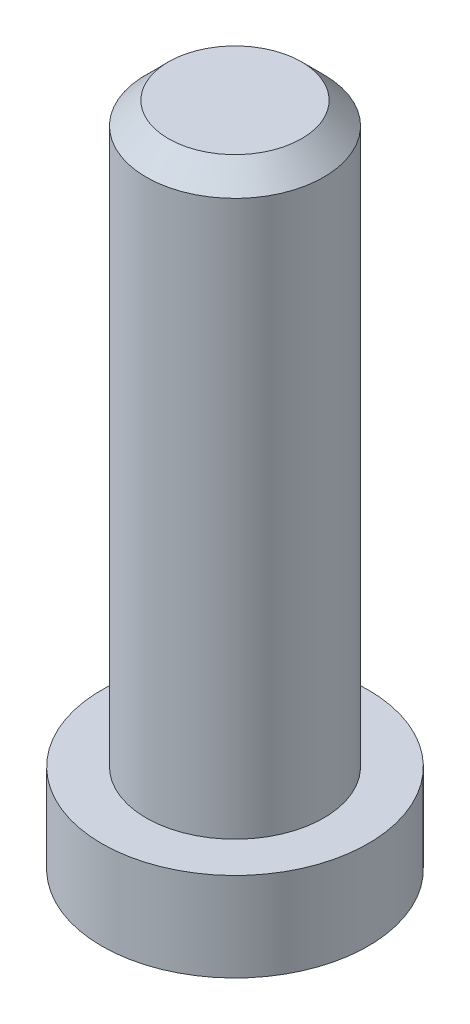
ISO-10303-21;
HEADER;
FILE_DESCRIPTION(('STEP AP214'),'2;1');
FILE_NAME('part.step','',(''),(''),'','','');
FILE_SCHEMA(('AUTOMOTIVE_DESIGN { 1 0 10303 214 1 1 1 1 }'));
ENDSEC;
DATA;
#1=APPLICATION_CONTEXT('core data for automotive mechanical design processes');
#2=APPLICATION_PROTOCOL_DEFINITION('international standard','automotive_design',2000,#1);
#3=PRODUCT_CONTEXT('',#1,'mechanical');
#4=PRODUCT('Part','Part','',(#3));
#5=PRODUCT_RELATED_PRODUCT_CATEGORY('part','',(#4));
#6=PRODUCT_DEFINITION_FORMATION('','',#4);
#7=PRODUCT_DEFINITION_CONTEXT('part definition',#1,'design');
#8=PRODUCT_DEFINITION('design','',#6,#7);
#9=PRODUCT_DEFINITION_SHAPE('','',#8);
#10=(LENGTH_UNIT() NAMED_UNIT(*) SI_UNIT(.MILLI.,.METRE.));
#11=(NAMED_UNIT(*) PLANE_ANGLE_UNIT() SI_UNIT($,.RADIAN.));
#12=(NAMED_UNIT(*) SI_UNIT($,.STERADIAN.) SOLID_ANGLE_UNIT());
#13=UNCERTAINTY_MEASURE_WITH_UNIT(LENGTH_MEASURE(1.E-05),#10,'distance_accuracy_value','');
#14=(GEOMETRIC_REPRESENTATION_CONTEXT(3) GLOBAL_UNCERTAINTY_ASSIGNED_CONTEXT((#13)) GLOBAL_UNIT_ASSIGNED_CONTEXT((#10,
#11,#12)) REPRESENTATION_CONTEXT('',''));
#15=CARTESIAN_POINT('',(0.,0.,0.));
#16=DIRECTION('',(0.,0.,1.));
#17=DIRECTION('',(1.,0.,0.));
#18=AXIS2_PLACEMENT_3D('',#15,#16,#17);
#19=CARTESIAN_POINT('',(0.,2.,0.));
#20=DIRECTION('',(0.,-1.,0.));
#21=DIRECTION('',(0.,0.,-1.));
#22=AXIS2_PLACEMENT_3D('',#19,#20,#21);
#23=CYLINDRICAL_SURFACE('',#22,3.);
#24=CARTESIAN_POINT('',(0.,2.,0.));
#25=DIRECTION('',(0.,1.,0.));
#26=DIRECTION('',(0.,0.,1.));
#27=AXIS2_PLACEMENT_3D('',#24,#25,#26);
#28=CIRCLE('',#27,3.);
#29=CARTESIAN_POINT('',(0.,2.,3.));
#30=VERTEX_POINT('',#29);
#31=EDGE_CURVE('E43',#30,#30,#28,.T.);
#32=ORIENTED_EDGE('',*,*,#31,.F.);
#33=EDGE_LOOP('',(#32));
#34=FACE_BOUND('',#33,.T.);
#35=CARTESIAN_POINT('',(0.,0.,0.));
#36=DIRECTION('',(0.,1.,0.));
#37=DIRECTION('',(0.,0.,1.));
#38=AXIS2_PLACEMENT_3D('',#35,#36,#37);
#39=CIRCLE('',#38,3.);
#40=CARTESIAN_POINT('',(0.,0.,3.));
#41=VERTEX_POINT('',#40);
#42=EDGE_CURVE('E47',#41,#41,#39,.T.);
#43=ORIENTED_EDGE('',*,*,#42,.T.);
#44=EDGE_LOOP('',(#43));
#45=FACE_BOUND('',#44,.T.);
#46=ADVANCED_FACE('F32',(#34,#45),#23,.T.);
#47=CARTESIAN_POINT('',(0.,2.,0.));
#48=DIRECTION('',(0.,1.,0.));
#49=DIRECTION('',(0.,0.,1.));
#50=AXIS2_PLACEMENT_3D('',#47,#48,#49);
#51=PLANE('',#50);
#52=CARTESIAN_POINT('',(0.,2.,0.));
#53=DIRECTION('',(0.,1.,0.));
#54=DIRECTION('',(0.,0.,1.));
#55=AXIS2_PLACEMENT_3D('',#52,#53,#54);
#56=CIRCLE('',#55,2.);
#57=CARTESIAN_POINT('',(0.,2.,-2.));
#58=VERTEX_POINT('',#57);
#59=EDGE_CURVE('E51',#58,#58,#56,.T.);
#60=ORIENTED_EDGE('',*,*,#59,.F.);
#61=EDGE_LOOP('',(#60));
#62=FACE_BOUND('',#61,.T.);
#63=ORIENTED_EDGE('',*,*,#31,.T.);
#64=EDGE_LOOP('',(#63));
#65=FACE_BOUND('',#64,.T.);
#66=ADVANCED_FACE('F58',(#62,#65),#51,.T.);
#67=CARTESIAN_POINT('',(0.,0.,0.));
#68=DIRECTION('',(0.,1.,0.));
#69=DIRECTION('',(0.,0.,1.));
#70=AXIS2_PLACEMENT_3D('',#67,#68,#69);
#71=PLANE('',#70);
#72=ORIENTED_EDGE('',*,*,#42,.F.);
#73=EDGE_LOOP('',(#72));
#74=FACE_BOUND('',#73,.T.);
#75=ADVANCED_FACE('F61',(#74),#71,.F.);
#76=CARTESIAN_POINT('',(0.,15.,0.));
#77=DIRECTION('',(0.,-1.,0.));
#78=DIRECTION('',(0.,0.,-1.));
#79=AXIS2_PLACEMENT_3D('',#76,#77,#78);
#80=CYLINDRICAL_SURFACE('',#79,2.);
#81=CARTESIAN_POINT('',(0.,14.5,0.));
#82=DIRECTION('',(0.,1.,0.));
#83=DIRECTION('',(0.,0.,1.));
#84=AXIS2_PLACEMENT_3D('',#81,#82,#83);
#85=CIRCLE('',#84,2.);
#86=CARTESIAN_POINT('',(0.,14.5,-2.));
#87=VERTEX_POINT('',#86);
#88=EDGE_CURVE('E10',#87,#87,#85,.F.);
#89=CARTESIAN_POINT('',(0.,14.5,-2.));
#90=CARTESIAN_POINT('',(0.,14.3697916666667,-2.));
#91=CARTESIAN_POINT('',(0.,14.2395833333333,-2.));
#92=CARTESIAN_POINT('',(0.,13.9791666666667,-2.));
#93=CARTESIAN_POINT('',(0.,13.8489583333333,-2.));
#94=CARTESIAN_POINT('',(0.,13.5885416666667,-2.));
#95=CARTESIAN_POINT('',(0.,13.4583333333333,-2.));
#96=CARTESIAN_POINT('',(0.,13.1979166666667,-2.));
#97=CARTESIAN_POINT('',(0.,13.0677083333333,-2.));
#98=CARTESIAN_POINT('',(0.,12.8072916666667,-2.));
#99=CARTESIAN_POINT('',(0.,12.6770833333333,-2.));
#100=CARTESIAN_POINT('',(0.,12.4166666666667,-2.));
#101=CARTESIAN_POINT('',(0.,12.2864583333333,-2.));
#102=CARTESIAN_POINT('',(0.,12.0260416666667,-2.));
#103=CARTESIAN_POINT('',(0.,11.8958333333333,-2.));
#104=CARTESIAN_POINT('',(0.,11.6354166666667,-2.));
#105=CARTESIAN_POINT('',(0.,11.5052083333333,-2.));
#106=CARTESIAN_POINT('',(0.,11.2447916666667,-2.));
#107=CARTESIAN_POINT('',(0.,11.1145833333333,-2.));
#108=CARTESIAN_POINT('',(0.,10.8541666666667,-2.));
#109=CARTESIAN_POINT('',(0.,10.7239583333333,-2.));
#110=CARTESIAN_POINT('',(0.,10.4635416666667,-2.));
#111=CARTESIAN_POINT('',(0.,10.3333333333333,-2.));
#112=CARTESIAN_POINT('',(0.,10.0729166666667,-2.));
#113=CARTESIAN_POINT('',(0.,9.94270833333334,-2.));
#114=CARTESIAN_POINT('',(0.,9.68229166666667,-2.));
#115=CARTESIAN_POINT('',(0.,9.55208333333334,-2.));
#116=CARTESIAN_POINT('',(0.,9.29166666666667,-2.));
#117=CARTESIAN_POINT('',(0.,9.16145833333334,-2.));
#118=CARTESIAN_POINT('',(0.,8.90104166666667,-2.));
#119=CARTESIAN_POINT('',(0.,8.77083333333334,-2.));
#120=CARTESIAN_POINT('',(0.,8.51041666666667,-2.));
#121=CARTESIAN_POINT('',(0.,8.38020833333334,-2.));
#122=CARTESIAN_POINT('',(0.,8.11979166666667,-2.));
#123=CARTESIAN_POINT('',(0.,7.98958333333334,-2.));
#124=CARTESIAN_POINT('',(0.,7.72916666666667,-2.));
#125=CARTESIAN_POINT('',(0.,7.59895833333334,-2.));
#126=CARTESIAN_POINT('',(0.,7.33854166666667,-2.));
#127=CARTESIAN_POINT('',(0.,7.20833333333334,-2.));
#128=CARTESIAN_POINT('',(0.,6.94791666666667,-2.));
#129=CARTESIAN_POINT('',(0.,6.81770833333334,-2.));
#130=CARTESIAN_POINT('',(0.,6.55729166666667,-2.));
#131=CARTESIAN_POINT('',(0.,6.42708333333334,-2.));
#132=CARTESIAN_POINT('',(0.,6.16666666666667,-2.));
#133=CARTESIAN_POINT('',(0.,6.03645833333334,-2.));
#134=CARTESIAN_POINT('',(0.,5.77604166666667,-2.));
#135=CARTESIAN_POINT('',(0.,5.64583333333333,-2.));
#136=CARTESIAN_POINT('',(0.,5.38541666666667,-2.));
#137=CARTESIAN_POINT('',(0.,5.25520833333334,-2.));
#138=CARTESIAN_POINT('',(0.,4.99479166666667,-2.));
#139=CARTESIAN_POINT('',(0.,4.86458333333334,-2.));
#140=CARTESIAN_POINT('',(0.,4.60416666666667,-2.));
#141=CARTESIAN_POINT('',(0.,4.47395833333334,-2.));
#142=CARTESIAN_POINT('',(0.,4.21354166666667,-2.));
#143=CARTESIAN_POINT('',(0.,4.08333333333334,-2.));
#144=CARTESIAN_POINT('',(0.,3.82291666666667,-2.));
#145=CARTESIAN_POINT('',(0.,3.69270833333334,-2.));
#146=CARTESIAN_POINT('',(0.,3.43229166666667,-2.));
#147=CARTESIAN_POINT('',(0.,3.30208333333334,-2.));
#148=CARTESIAN_POINT('',(0.,3.04166666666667,-2.));
#149=CARTESIAN_POINT('',(0.,2.91145833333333,-2.));
#150=CARTESIAN_POINT('',(0.,2.65104166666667,-2.));
#151=CARTESIAN_POINT('',(0.,2.52083333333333,-2.));
#152=CARTESIAN_POINT('',(0.,2.26041666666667,-2.));
#153=CARTESIAN_POINT('',(0.,2.13020833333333,-2.));
#154=CARTESIAN_POINT('',(0.,2.,-2.));
#155=B_SPLINE_CURVE_WITH_KNOTS('',3,(#89,#90,#91,#92,#93,#94,#95,#96,#97,#98,#99,#100,#101,#102,
#103,#104,#105,#106,#107,#108,#109,#110,#111,#112,#113,#114,#115,#116,#117,#118,#119,#120,#121,
#122,#123,#124,#125,#126,#127,#128,#129,#130,#131,#132,#133,#134,#135,#136,#137,#138,#139,#140,
#141,#142,#143,#144,#145,#146,#147,#148,#149,#150,#151,#152,#153,#154),.UNSPECIFIED.,.F.,.F.,(4,
2,2,2,2,2,2,2,2,2,2,2,2,2,2,2,2,2,2,2,2,2,2,2,2,2,2,2,2,2,2,2,4),(0.,0.390625,0.781250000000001,
1.171875,1.5625,1.953125,2.34375,2.734375,3.125,3.515625,3.90625,4.296875,4.6875,5.078125,
5.46875,5.859375,6.25,6.640625,7.03125,7.421875,7.8125,8.20312500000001,8.59375,
8.98437500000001,9.37500000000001,9.765625,10.15625,10.546875,10.9375,11.328125,11.71875,
12.109375,12.5),.UNSPECIFIED.);
#156=EDGE_CURVE('BSEAM56',#87,#58,#155,.T.);
#157=ORIENTED_EDGE('',*,*,#88,.T.);
#158=ORIENTED_EDGE('',*,*,#59,.T.);
#159=ORIENTED_EDGE('',*,*,#156,.T.);
#160=ORIENTED_EDGE('',*,*,#156,.F.);
#161=EDGE_LOOP('',(#157,#159,#158,#160));
#162=FACE_BOUND('',#161,.T.);
#163=ADVANCED_FACE('F56',(#162),#80,.T.);
#164=CARTESIAN_POINT('',(0.,15.,0.));
#165=DIRECTION('',(0.,1.,0.));
#166=DIRECTION('',(0.,0.,1.));
#167=AXIS2_PLACEMENT_3D('',#164,#165,#166);
#168=PLANE('',#167);
#169=CARTESIAN_POINT('',(0.,15.,0.));
#170=DIRECTION('',(0.,1.,0.));
#171=DIRECTION('',(0.,0.,1.));
#172=AXIS2_PLACEMENT_3D('',#169,#170,#171);
#173=CIRCLE('',#172,1.50000000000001);
#174=CARTESIAN_POINT('',(0.,15.,1.50000000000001));
#175=VERTEX_POINT('',#174);
#176=EDGE_CURVE('E39',#175,#175,#173,.T.);
#177=ORIENTED_EDGE('',*,*,#176,.T.);
#178=EDGE_LOOP('',(#177));
#179=FACE_BOUND('',#178,.T.);
#180=ADVANCED_FACE('F74',(#179),#168,.T.);
#181=CARTESIAN_POINT('',(0.,15.,0.));
#182=DIRECTION('',(0.,-1.,0.));
#183=DIRECTION('',(0.,0.,-1.));
#184=AXIS2_PLACEMENT_3D('',#181,#182,#183);
#185=CONICAL_SURFACE('',#184,1.50000000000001,0.785398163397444);
#186=ORIENTED_EDGE('',*,*,#88,.F.);
#187=EDGE_LOOP('',(#186));
#188=FACE_BOUND('',#187,.T.);
#189=ORIENTED_EDGE('',*,*,#176,.F.);
#190=EDGE_LOOP('',(#189));
#191=FACE_BOUND('',#190,.T.);
#192=ADVANCED_FACE('F34',(#188,#191),#185,.T.);
#193=CLOSED_SHELL('',(#46,#66,#75,#163,#180,#192));
#194=MANIFOLD_SOLID_BREP('B2',#193);
#195=ADVANCED_BREP_SHAPE_REPRESENTATION('',(#18,#194),#14);
#196=SHAPE_DEFINITION_REPRESENTATION(#9,#195);
ENDSEC;
END-ISO-10303-21;
